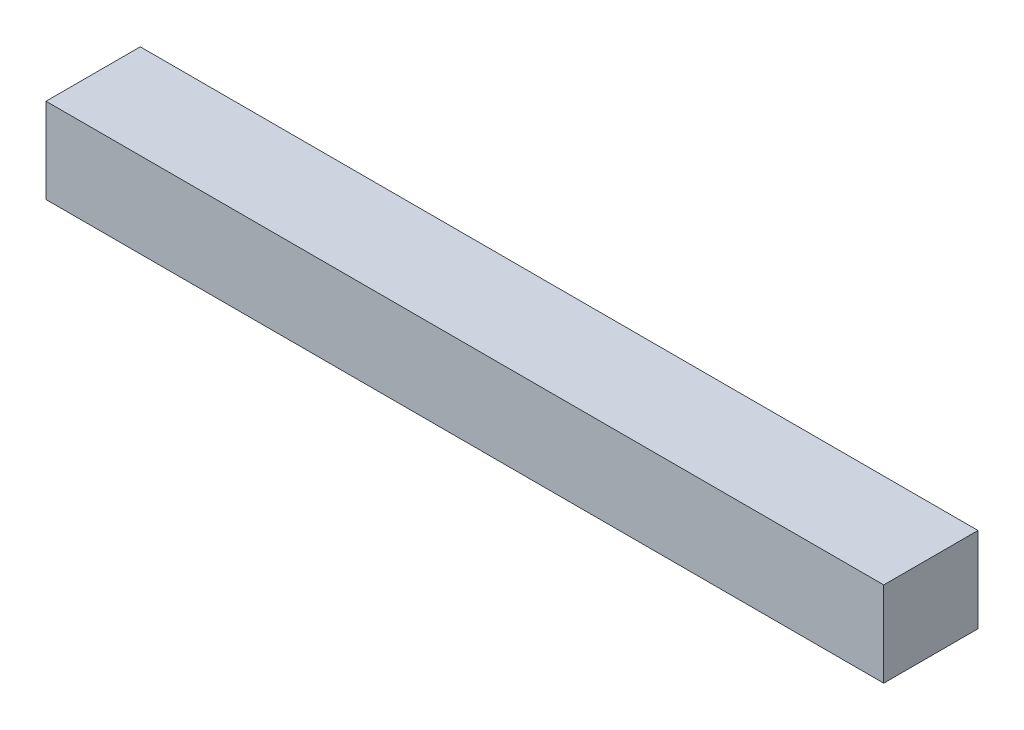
ISO-10303-21;
HEADER;
FILE_DESCRIPTION(('STEP AP214'),'2;1');
FILE_NAME('part.step','',(''),(''),'','','');
FILE_SCHEMA(('AUTOMOTIVE_DESIGN { 1 0 10303 214 1 1 1 1 }'));
ENDSEC;
DATA;
#1=APPLICATION_CONTEXT('core data for automotive mechanical design processes');
#2=APPLICATION_PROTOCOL_DEFINITION('international standard','automotive_design',2000,#1);
#3=PRODUCT_CONTEXT('',#1,'mechanical');
#4=PRODUCT('Part','Part','',(#3));
#5=PRODUCT_RELATED_PRODUCT_CATEGORY('part','',(#4));
#6=PRODUCT_DEFINITION_FORMATION('','',#4);
#7=PRODUCT_DEFINITION_CONTEXT('part definition',#1,'design');
#8=PRODUCT_DEFINITION('design','',#6,#7);
#9=PRODUCT_DEFINITION_SHAPE('','',#8);
#10=(LENGTH_UNIT() NAMED_UNIT(*) SI_UNIT(.MILLI.,.METRE.));
#11=(NAMED_UNIT(*) PLANE_ANGLE_UNIT() SI_UNIT($,.RADIAN.));
#12=(NAMED_UNIT(*) SI_UNIT($,.STERADIAN.) SOLID_ANGLE_UNIT());
#13=UNCERTAINTY_MEASURE_WITH_UNIT(LENGTH_MEASURE(1.E-05),#10,'distance_accuracy_value','');
#14=(GEOMETRIC_REPRESENTATION_CONTEXT(3) GLOBAL_UNCERTAINTY_ASSIGNED_CONTEXT((#13)) GLOBAL_UNIT_ASSIGNED_CONTEXT((#10,
#11,#12)) REPRESENTATION_CONTEXT('',''));
#15=CARTESIAN_POINT('',(0.,0.,0.));
#16=DIRECTION('',(0.,0.,1.));
#17=DIRECTION('',(1.,0.,0.));
#18=AXIS2_PLACEMENT_3D('',#15,#16,#17);
#19=CARTESIAN_POINT('',(-137.75,28.,15.5));
#20=DIRECTION('',(0.,0.,-1.));
#21=DIRECTION('',(-1.,0.,0.));
#22=AXIS2_PLACEMENT_3D('',#19,#20,#21);
#23=PLANE('',#22);
#24=DIRECTION('',(1.,0.,0.));
#25=VECTOR('',#24,1.);
#26=CARTESIAN_POINT('',(-137.75,0.,15.5));
#27=LINE('',#26,#25);
#28=CARTESIAN_POINT('',(-137.75,0.,15.5));
#29=VERTEX_POINT('',#28);
#30=CARTESIAN_POINT('',(137.75,0.,15.5));
#31=VERTEX_POINT('',#30);
#32=EDGE_CURVE('E116',#29,#31,#27,.T.);
#33=ORIENTED_EDGE('',*,*,#32,.T.);
#34=DIRECTION('',(0.,-1.,0.));
#35=VECTOR('',#34,1.);
#36=CARTESIAN_POINT('',(137.75,28.,15.5));
#37=LINE('',#36,#35);
#38=CARTESIAN_POINT('',(137.75,28.,15.5));
#39=VERTEX_POINT('',#38);
#40=EDGE_CURVE('E11',#39,#31,#37,.T.);
#41=ORIENTED_EDGE('',*,*,#40,.F.);
#42=DIRECTION('',(1.,0.,0.));
#43=VECTOR('',#42,1.);
#44=CARTESIAN_POINT('',(-137.75,28.,15.5));
#45=LINE('',#44,#43);
#46=CARTESIAN_POINT('',(-137.75,28.,15.5));
#47=VERTEX_POINT('',#46);
#48=EDGE_CURVE('E77',#47,#39,#45,.T.);
#49=ORIENTED_EDGE('',*,*,#48,.F.);
#50=DIRECTION('',(0.,-1.,0.));
#51=VECTOR('',#50,1.);
#52=CARTESIAN_POINT('',(-137.75,28.,15.5));
#53=LINE('',#52,#51);
#54=EDGE_CURVE('E156',#47,#29,#53,.T.);
#55=ORIENTED_EDGE('',*,*,#54,.T.);
#56=EDGE_LOOP('',(#33,#41,#49,#55));
#57=FACE_BOUND('',#56,.T.);
#58=ADVANCED_FACE('F37',(#57),#23,.F.);
#59=CARTESIAN_POINT('',(137.75,28.,-15.5));
#60=DIRECTION('',(1.,0.,0.));
#61=DIRECTION('',(0.,0.,-1.));
#62=AXIS2_PLACEMENT_3D('',#59,#60,#61);
#63=PLANE('',#62);
#64=DIRECTION('',(0.,0.,1.));
#65=VECTOR('',#64,1.);
#66=CARTESIAN_POINT('',(137.75,0.,-15.5));
#67=LINE('',#66,#65);
#68=CARTESIAN_POINT('',(137.75,0.,-15.5));
#69=VERTEX_POINT('',#68);
#70=EDGE_CURVE('E159',#69,#31,#67,.T.);
#71=ORIENTED_EDGE('',*,*,#70,.F.);
#72=DIRECTION('',(0.,-1.,0.));
#73=VECTOR('',#72,1.);
#74=CARTESIAN_POINT('',(137.75,28.,-15.5));
#75=LINE('',#74,#73);
#76=CARTESIAN_POINT('',(137.75,28.,-15.5));
#77=VERTEX_POINT('',#76);
#78=EDGE_CURVE('E45',#77,#69,#75,.T.);
#79=ORIENTED_EDGE('',*,*,#78,.F.);
#80=DIRECTION('',(0.,0.,1.));
#81=VECTOR('',#80,1.);
#82=CARTESIAN_POINT('',(137.75,28.,-15.5));
#83=LINE('',#82,#81);
#84=EDGE_CURVE('E149',#77,#39,#83,.T.);
#85=ORIENTED_EDGE('',*,*,#84,.T.);
#86=ORIENTED_EDGE('',*,*,#40,.T.);
#87=EDGE_LOOP('',(#71,#79,#85,#86));
#88=FACE_BOUND('',#87,.T.);
#89=ADVANCED_FACE('F172',(#88),#63,.T.);
#90=CARTESIAN_POINT('',(-137.75,28.,-15.5));
#91=DIRECTION('',(0.,0.,-1.));
#92=DIRECTION('',(-1.,0.,0.));
#93=AXIS2_PLACEMENT_3D('',#90,#91,#92);
#94=PLANE('',#93);
#95=DIRECTION('',(1.,0.,0.));
#96=VECTOR('',#95,1.);
#97=CARTESIAN_POINT('',(-137.75,0.,-15.5));
#98=LINE('',#97,#96);
#99=CARTESIAN_POINT('',(-137.75,0.,-15.5));
#100=VERTEX_POINT('',#99);
#101=EDGE_CURVE('E162',#100,#69,#98,.T.);
#102=ORIENTED_EDGE('',*,*,#101,.F.);
#103=DIRECTION('',(0.,-1.,0.));
#104=VECTOR('',#103,1.);
#105=CARTESIAN_POINT('',(-137.75,28.,-15.5));
#106=LINE('',#105,#104);
#107=CARTESIAN_POINT('',(-137.75,28.,-15.5));
#108=VERTEX_POINT('',#107);
#109=EDGE_CURVE('E69',#108,#100,#106,.T.);
#110=ORIENTED_EDGE('',*,*,#109,.F.);
#111=DIRECTION('',(1.,0.,0.));
#112=VECTOR('',#111,1.);
#113=CARTESIAN_POINT('',(-137.75,28.,-15.5));
#114=LINE('',#113,#112);
#115=EDGE_CURVE('E152',#108,#77,#114,.T.);
#116=ORIENTED_EDGE('',*,*,#115,.T.);
#117=ORIENTED_EDGE('',*,*,#78,.T.);
#118=EDGE_LOOP('',(#102,#110,#116,#117));
#119=FACE_BOUND('',#118,.T.);
#120=ADVANCED_FACE('F170',(#119),#94,.T.);
#121=CARTESIAN_POINT('',(-137.75,28.,-15.5));
#122=DIRECTION('',(1.,0.,0.));
#123=DIRECTION('',(0.,0.,-1.));
#124=AXIS2_PLACEMENT_3D('',#121,#122,#123);
#125=PLANE('',#124);
#126=DIRECTION('',(0.,0.,1.));
#127=VECTOR('',#126,1.);
#128=CARTESIAN_POINT('',(-137.75,0.,-15.5));
#129=LINE('',#128,#127);
#130=EDGE_CURVE('E72',#100,#29,#129,.T.);
#131=ORIENTED_EDGE('',*,*,#130,.T.);
#132=ORIENTED_EDGE('',*,*,#54,.F.);
#133=DIRECTION('',(0.,0.,1.));
#134=VECTOR('',#133,1.);
#135=CARTESIAN_POINT('',(-137.75,28.,-15.5));
#136=LINE('',#135,#134);
#137=EDGE_CURVE('E53',#108,#47,#136,.T.);
#138=ORIENTED_EDGE('',*,*,#137,.F.);
#139=ORIENTED_EDGE('',*,*,#109,.T.);
#140=EDGE_LOOP('',(#131,#132,#138,#139));
#141=FACE_BOUND('',#140,.T.);
#142=ADVANCED_FACE('F177',(#141),#125,.F.);
#143=CARTESIAN_POINT('',(0.,28.,0.));
#144=DIRECTION('',(0.,-1.,0.));
#145=DIRECTION('',(0.,0.,-1.));
#146=AXIS2_PLACEMENT_3D('',#143,#144,#145);
#147=PLANE('',#146);
#148=ORIENTED_EDGE('',*,*,#48,.T.);
#149=ORIENTED_EDGE('',*,*,#84,.F.);
#150=ORIENTED_EDGE('',*,*,#115,.F.);
#151=ORIENTED_EDGE('',*,*,#137,.T.);
#152=EDGE_LOOP('',(#148,#149,#150,#151));
#153=FACE_BOUND('',#152,.T.);
#154=ADVANCED_FACE('F178',(#153),#147,.F.);
#155=CARTESIAN_POINT('',(0.,0.,0.));
#156=DIRECTION('',(0.,-1.,0.));
#157=DIRECTION('',(0.,0.,-1.));
#158=AXIS2_PLACEMENT_3D('',#155,#156,#157);
#159=PLANE('',#158);
#160=ORIENTED_EDGE('',*,*,#32,.F.);
#161=ORIENTED_EDGE('',*,*,#130,.F.);
#162=ORIENTED_EDGE('',*,*,#101,.T.);
#163=ORIENTED_EDGE('',*,*,#70,.T.);
#164=EDGE_LOOP('',(#160,#161,#162,#163));
#165=FACE_BOUND('',#164,.T.);
#166=ADVANCED_FACE('F175',(#165),#159,.T.);
#167=CLOSED_SHELL('',(#58,#89,#120,#142,#154,#166));
#168=CARTESIAN_POINT('',(0.,22.,-9.5));
#169=DIRECTION('',(0.,0.,-1.));
#170=DIRECTION('',(-1.,0.,0.));
#171=AXIS2_PLACEMENT_3D('',#168,#169,#170);
#172=PLANE('',#171);
#173=DIRECTION('',(1.,0.,0.));
#174=VECTOR('',#173,1.);
#175=CARTESIAN_POINT('',(0.,6.,-9.5));
#176=LINE('',#175,#174);
#177=CARTESIAN_POINT('',(-131.75,6.,-9.5));
#178=VERTEX_POINT('',#177);
#179=CARTESIAN_POINT('',(131.75,6.,-9.5));
#180=VERTEX_POINT('',#179);
#181=EDGE_CURVE('E139',#178,#180,#176,.T.);
#182=ORIENTED_EDGE('',*,*,#181,.T.);
#183=DIRECTION('',(0.,-1.,0.));
#184=VECTOR('',#183,1.);
#185=CARTESIAN_POINT('',(131.75,22.,-9.5));
#186=LINE('',#185,#184);
#187=CARTESIAN_POINT('',(131.75,22.,-9.5));
#188=VERTEX_POINT('',#187);
#189=EDGE_CURVE('E129',#188,#180,#186,.T.);
#190=ORIENTED_EDGE('',*,*,#189,.F.);
#191=DIRECTION('',(1.,0.,0.));
#192=VECTOR('',#191,1.);
#193=CARTESIAN_POINT('',(0.,22.,-9.5));
#194=LINE('',#193,#192);
#195=CARTESIAN_POINT('',(-131.75,22.,-9.5));
#196=VERTEX_POINT('',#195);
#197=EDGE_CURVE('E124',#196,#188,#194,.T.);
#198=ORIENTED_EDGE('',*,*,#197,.F.);
#199=DIRECTION('',(0.,-1.,0.));
#200=VECTOR('',#199,1.);
#201=CARTESIAN_POINT('',(-131.75,22.,-9.5));
#202=LINE('',#201,#200);
#203=EDGE_CURVE('E105',#196,#178,#202,.T.);
#204=ORIENTED_EDGE('',*,*,#203,.T.);
#205=EDGE_LOOP('',(#182,#190,#198,#204));
#206=FACE_BOUND('',#205,.T.);
#207=ADVANCED_FACE('F128',(#206),#172,.F.);
#208=CARTESIAN_POINT('',(-131.75,22.,0.));
#209=DIRECTION('',(1.,0.,0.));
#210=DIRECTION('',(0.,0.,-1.));
#211=AXIS2_PLACEMENT_3D('',#208,#209,#210);
#212=PLANE('',#211);
#213=DIRECTION('',(0.,0.,1.));
#214=VECTOR('',#213,1.);
#215=CARTESIAN_POINT('',(-131.75,6.,0.));
#216=LINE('',#215,#214);
#217=CARTESIAN_POINT('',(-131.75,6.,9.5));
#218=VERTEX_POINT('',#217);
#219=EDGE_CURVE('E111',#178,#218,#216,.T.);
#220=ORIENTED_EDGE('',*,*,#219,.F.);
#221=ORIENTED_EDGE('',*,*,#203,.F.);
#222=DIRECTION('',(0.,0.,1.));
#223=VECTOR('',#222,1.);
#224=CARTESIAN_POINT('',(-131.75,22.,0.));
#225=LINE('',#224,#223);
#226=CARTESIAN_POINT('',(-131.75,22.,9.5));
#227=VERTEX_POINT('',#226);
#228=EDGE_CURVE('E109',#196,#227,#225,.T.);
#229=ORIENTED_EDGE('',*,*,#228,.T.);
#230=DIRECTION('',(0.,-1.,0.));
#231=VECTOR('',#230,1.);
#232=CARTESIAN_POINT('',(-131.75,22.,9.5));
#233=LINE('',#232,#231);
#234=EDGE_CURVE('E117',#227,#218,#233,.T.);
#235=ORIENTED_EDGE('',*,*,#234,.T.);
#236=EDGE_LOOP('',(#220,#221,#229,#235));
#237=FACE_BOUND('',#236,.T.);
#238=ADVANCED_FACE('F107',(#237),#212,.T.);
#239=CARTESIAN_POINT('',(0.,22.,9.5));
#240=DIRECTION('',(0.,0.,-1.));
#241=DIRECTION('',(-1.,0.,0.));
#242=AXIS2_PLACEMENT_3D('',#239,#240,#241);
#243=PLANE('',#242);
#244=DIRECTION('',(1.,0.,0.));
#245=VECTOR('',#244,1.);
#246=CARTESIAN_POINT('',(0.,6.,9.5));
#247=LINE('',#246,#245);
#248=CARTESIAN_POINT('',(131.75,6.,9.5));
#249=VERTEX_POINT('',#248);
#250=EDGE_CURVE('E133',#218,#249,#247,.T.);
#251=ORIENTED_EDGE('',*,*,#250,.F.);
#252=ORIENTED_EDGE('',*,*,#234,.F.);
#253=DIRECTION('',(1.,0.,0.));
#254=VECTOR('',#253,1.);
#255=CARTESIAN_POINT('',(0.,22.,9.5));
#256=LINE('',#255,#254);
#257=CARTESIAN_POINT('',(131.75,22.,9.5));
#258=VERTEX_POINT('',#257);
#259=EDGE_CURVE('E126',#227,#258,#256,.T.);
#260=ORIENTED_EDGE('',*,*,#259,.T.);
#261=DIRECTION('',(0.,-1.,0.));
#262=VECTOR('',#261,1.);
#263=CARTESIAN_POINT('',(131.75,22.,9.5));
#264=LINE('',#263,#262);
#265=EDGE_CURVE('E145',#258,#249,#264,.T.);
#266=ORIENTED_EDGE('',*,*,#265,.T.);
#267=EDGE_LOOP('',(#251,#252,#260,#266));
#268=FACE_BOUND('',#267,.T.);
#269=ADVANCED_FACE('F233',(#268),#243,.T.);
#270=CARTESIAN_POINT('',(131.75,22.,0.));
#271=DIRECTION('',(1.,0.,0.));
#272=DIRECTION('',(0.,0.,-1.));
#273=AXIS2_PLACEMENT_3D('',#270,#271,#272);
#274=PLANE('',#273);
#275=DIRECTION('',(0.,0.,1.));
#276=VECTOR('',#275,1.);
#277=CARTESIAN_POINT('',(131.75,6.,0.));
#278=LINE('',#277,#276);
#279=EDGE_CURVE('E130',#180,#249,#278,.T.);
#280=ORIENTED_EDGE('',*,*,#279,.T.);
#281=ORIENTED_EDGE('',*,*,#265,.F.);
#282=DIRECTION('',(0.,0.,1.));
#283=VECTOR('',#282,1.);
#284=CARTESIAN_POINT('',(131.75,22.,0.));
#285=LINE('',#284,#283);
#286=EDGE_CURVE('E137',#188,#258,#285,.T.);
#287=ORIENTED_EDGE('',*,*,#286,.F.);
#288=ORIENTED_EDGE('',*,*,#189,.T.);
#289=EDGE_LOOP('',(#280,#281,#287,#288));
#290=FACE_BOUND('',#289,.T.);
#291=ADVANCED_FACE('F243',(#290),#274,.F.);
#292=CARTESIAN_POINT('',(0.,22.,0.));
#293=DIRECTION('',(0.,1.,0.));
#294=DIRECTION('',(0.,0.,1.));
#295=AXIS2_PLACEMENT_3D('',#292,#293,#294);
#296=PLANE('',#295);
#297=ORIENTED_EDGE('',*,*,#197,.T.);
#298=ORIENTED_EDGE('',*,*,#286,.T.);
#299=ORIENTED_EDGE('',*,*,#259,.F.);
#300=ORIENTED_EDGE('',*,*,#228,.F.);
#301=EDGE_LOOP('',(#297,#298,#299,#300));
#302=FACE_BOUND('',#301,.T.);
#303=ADVANCED_FACE('F122',(#302),#296,.F.);
#304=CARTESIAN_POINT('',(0.,6.,0.));
#305=DIRECTION('',(0.,1.,0.));
#306=DIRECTION('',(0.,0.,1.));
#307=AXIS2_PLACEMENT_3D('',#304,#305,#306);
#308=PLANE('',#307);
#309=ORIENTED_EDGE('',*,*,#181,.F.);
#310=ORIENTED_EDGE('',*,*,#219,.T.);
#311=ORIENTED_EDGE('',*,*,#250,.T.);
#312=ORIENTED_EDGE('',*,*,#279,.F.);
#313=EDGE_LOOP('',(#309,#310,#311,#312));
#314=FACE_BOUND('',#313,.T.);
#315=ADVANCED_FACE('F264',(#314),#308,.T.);
#316=CLOSED_SHELL('',(#207,#238,#269,#291,#303,#315));
#317=ORIENTED_CLOSED_SHELL('',*,#316,.T.);
#318=BREP_WITH_VOIDS('B2',#167,(#317));
#319=ADVANCED_BREP_SHAPE_REPRESENTATION('',(#18,#318),#14);
#320=SHAPE_DEFINITION_REPRESENTATION(#9,#319);
ENDSEC;
END-ISO-10303-21;
